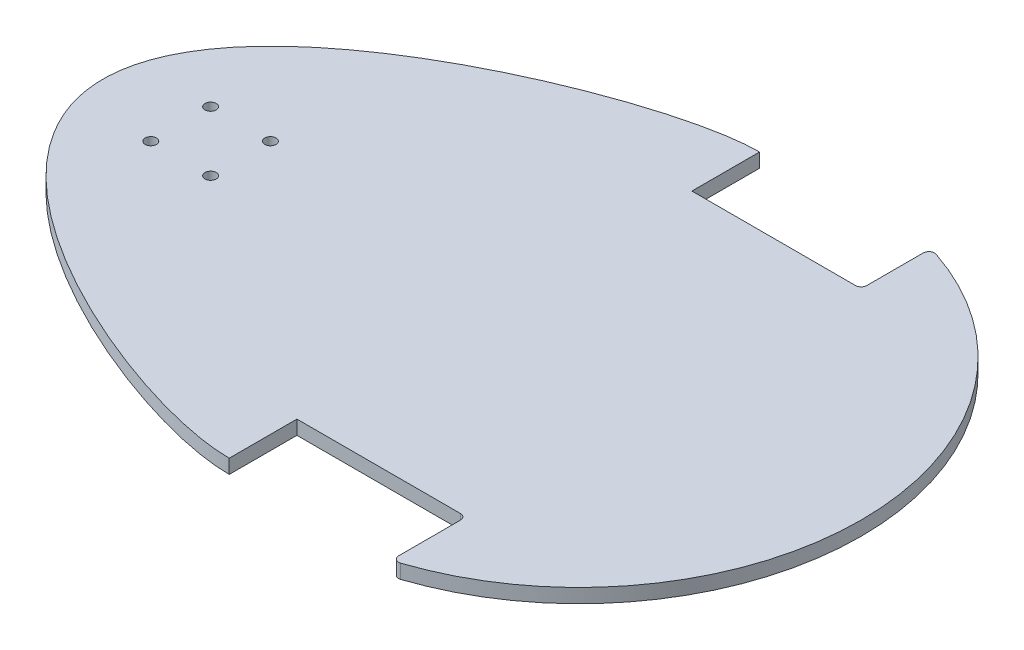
ISO-10303-21;
HEADER;
FILE_DESCRIPTION(('STEP AP214'),'2;1');
FILE_NAME('part.step','',(''),(''),'','','');
FILE_SCHEMA(('AUTOMOTIVE_DESIGN { 1 0 10303 214 1 1 1 1 }'));
ENDSEC;
DATA;
#1=APPLICATION_CONTEXT('core data for automotive mechanical design processes');
#2=APPLICATION_PROTOCOL_DEFINITION('international standard','automotive_design',2000,#1);
#3=PRODUCT_CONTEXT('',#1,'mechanical');
#4=PRODUCT('Part','Part','',(#3));
#5=PRODUCT_RELATED_PRODUCT_CATEGORY('part','',(#4));
#6=PRODUCT_DEFINITION_FORMATION('','',#4);
#7=PRODUCT_DEFINITION_CONTEXT('part definition',#1,'design');
#8=PRODUCT_DEFINITION('design','',#6,#7);
#9=PRODUCT_DEFINITION_SHAPE('','',#8);
#10=(LENGTH_UNIT() NAMED_UNIT(*) SI_UNIT(.MILLI.,.METRE.));
#11=(NAMED_UNIT(*) PLANE_ANGLE_UNIT() SI_UNIT($,.RADIAN.));
#12=(NAMED_UNIT(*) SI_UNIT($,.STERADIAN.) SOLID_ANGLE_UNIT());
#13=UNCERTAINTY_MEASURE_WITH_UNIT(LENGTH_MEASURE(1.E-05),#10,'distance_accuracy_value','');
#14=(GEOMETRIC_REPRESENTATION_CONTEXT(3) GLOBAL_UNCERTAINTY_ASSIGNED_CONTEXT((#13)) GLOBAL_UNIT_ASSIGNED_CONTEXT((#10,
#11,#12)) REPRESENTATION_CONTEXT('',''));
#15=CARTESIAN_POINT('',(0.,0.,0.));
#16=DIRECTION('',(0.,0.,1.));
#17=DIRECTION('',(1.,0.,0.));
#18=AXIS2_PLACEMENT_3D('',#15,#16,#17);
#19=CARTESIAN_POINT('',(-95.19961207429,6.35,115.672720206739));
#20=DIRECTION('',(0.,-1.,0.));
#21=DIRECTION('',(0.,0.,-1.));
#22=AXIS2_PLACEMENT_3D('',#19,#20,#21);
#23=PLANE('',#22);
#24=DIRECTION('',(0.,0.,-1.));
#25=VECTOR('',#24,1.);
#26=CARTESIAN_POINT('',(81.01288792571,6.35,204.572720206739));
#27=LINE('',#26,#25);
#28=CARTESIAN_POINT('',(81.01288792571,6.35,235.052720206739));
#29=VERTEX_POINT('',#28);
#30=CARTESIAN_POINT('',(81.01288792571,6.35,204.572720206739));
#31=VERTEX_POINT('',#30);
#32=EDGE_CURVE('E258',#29,#31,#27,.T.);
#33=ORIENTED_EDGE('',*,*,#32,.T.);
#34=DIRECTION('',(1.,0.,0.));
#35=VECTOR('',#34,1.);
#36=CARTESIAN_POINT('',(81.01288792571,6.35,204.572720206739));
#37=LINE('',#36,#35);
#38=CARTESIAN_POINT('',(154.67288792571,6.35,204.572720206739));
#39=VERTEX_POINT('',#38);
#40=EDGE_CURVE('E105',#31,#39,#37,.T.);
#41=ORIENTED_EDGE('',*,*,#40,.T.);
#42=CARTESIAN_POINT('',(154.67288792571,6.35,207.112720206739));
#43=DIRECTION('',(0.,-1.,0.));
#44=DIRECTION('',(0.,0.,-1.));
#45=AXIS2_PLACEMENT_3D('',#42,#43,#44);
#46=CIRCLE('',#45,2.53999999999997);
#47=CARTESIAN_POINT('',(157.21288792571,6.35,207.112720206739));
#48=VERTEX_POINT('',#47);
#49=EDGE_CURVE('E261',#39,#48,#46,.T.);
#50=ORIENTED_EDGE('',*,*,#49,.T.);
#51=DIRECTION('',(0.,0.,1.));
#52=VECTOR('',#51,1.);
#53=CARTESIAN_POINT('',(157.21288792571,6.35,207.112720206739));
#54=LINE('',#53,#52);
#55=CARTESIAN_POINT('',(157.21288792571,6.35,234.970770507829));
#56=VERTEX_POINT('',#55);
#57=EDGE_CURVE('E263',#48,#56,#54,.T.);
#58=ORIENTED_EDGE('',*,*,#57,.T.);
#59=CARTESIAN_POINT('',(159.75288792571,6.35,234.970770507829));
#60=DIRECTION('',(0.,1.,0.));
#61=DIRECTION('',(0.,0.,1.));
#62=AXIS2_PLACEMENT_3D('',#59,#60,#61);
#63=CIRCLE('',#62,2.54000000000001);
#64=CARTESIAN_POINT('',(160.556357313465,6.35,237.380342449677));
#65=VERTEX_POINT('',#64);
#66=EDGE_CURVE('E265',#56,#65,#63,.T.);
#67=ORIENTED_EDGE('',*,*,#66,.T.);
#68=CARTESIAN_POINT('',(120.38288792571,6.35,116.901745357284));
#69=DIRECTION('',(0.,1.,0.));
#70=DIRECTION('',(0.,0.,1.));
#71=AXIS2_PLACEMENT_3D('',#68,#69,#70);
#72=CIRCLE('',#71,127.);
#73=CARTESIAN_POINT('',(160.556357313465,6.35,-3.57685173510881));
#74=VERTEX_POINT('',#73);
#75=EDGE_CURVE('E267',#65,#74,#72,.T.);
#76=ORIENTED_EDGE('',*,*,#75,.T.);
#77=CARTESIAN_POINT('',(159.75288792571,6.35,-1.16727979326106));
#78=DIRECTION('',(0.,1.,0.));
#79=DIRECTION('',(0.,0.,-1.));
#80=AXIS2_PLACEMENT_3D('',#77,#78,#79);
#81=CIRCLE('',#80,2.53999999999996);
#82=CARTESIAN_POINT('',(157.21288792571,6.35,-1.16727979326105));
#83=VERTEX_POINT('',#82);
#84=EDGE_CURVE('E269',#74,#83,#81,.T.);
#85=ORIENTED_EDGE('',*,*,#84,.T.);
#86=DIRECTION('',(0.,0.,1.));
#87=VECTOR('',#86,1.);
#88=CARTESIAN_POINT('',(157.21288792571,6.35,-1.16727979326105));
#89=LINE('',#88,#87);
#90=CARTESIAN_POINT('',(157.21288792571,6.35,24.2327202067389));
#91=VERTEX_POINT('',#90);
#92=EDGE_CURVE('E271',#83,#91,#89,.T.);
#93=ORIENTED_EDGE('',*,*,#92,.T.);
#94=CARTESIAN_POINT('',(154.67288792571,6.35,24.2327202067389));
#95=DIRECTION('',(0.,-1.,0.));
#96=DIRECTION('',(0.,0.,1.));
#97=AXIS2_PLACEMENT_3D('',#94,#95,#96);
#98=CIRCLE('',#97,2.54000000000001);
#99=CARTESIAN_POINT('',(154.67288792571,6.35,26.772720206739));
#100=VERTEX_POINT('',#99);
#101=EDGE_CURVE('E136',#91,#100,#98,.T.);
#102=ORIENTED_EDGE('',*,*,#101,.T.);
#103=DIRECTION('',(-1.,0.,0.));
#104=VECTOR('',#103,1.);
#105=CARTESIAN_POINT('',(81.01288792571,6.35,26.7727202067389));
#106=LINE('',#105,#104);
#107=CARTESIAN_POINT('',(81.01288792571,6.35,26.7727202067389));
#108=VERTEX_POINT('',#107);
#109=EDGE_CURVE('E130',#100,#108,#106,.T.);
#110=ORIENTED_EDGE('',*,*,#109,.T.);
#111=DIRECTION('',(0.,0.,-1.));
#112=VECTOR('',#111,1.);
#113=CARTESIAN_POINT('',(81.01288792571,6.35,26.7727202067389));
#114=LINE('',#113,#112);
#115=CARTESIAN_POINT('',(81.01288792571,6.35,-3.70727979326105));
#116=VERTEX_POINT('',#115);
#117=EDGE_CURVE('E134',#108,#116,#114,.T.);
#118=ORIENTED_EDGE('',*,*,#117,.T.);
#119=CARTESIAN_POINT('',(81.01288792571,6.35,-3.70727979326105));
#120=CARTESIAN_POINT('',(17.51288792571,6.35,-3.70727979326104));
#121=CARTESIAN_POINT('',(-169.17711207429,6.35,85.1927202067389));
#122=CARTESIAN_POINT('',(-169.17711207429,6.35,146.152720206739));
#123=CARTESIAN_POINT('',(17.51288792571,6.35,235.052720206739));
#124=CARTESIAN_POINT('',(81.01288792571,6.35,235.052720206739));
#125=B_SPLINE_CURVE_WITH_KNOTS('',5,(#119,#120,#121,#122,#123,#124),.UNSPECIFIED.,.F.,.F.,(6,6),
(0.,1.),.UNSPECIFIED.);
#126=EDGE_CURVE('E50',#116,#29,#125,.T.);
#127=ORIENTED_EDGE('',*,*,#126,.T.);
#128=EDGE_LOOP('',(#33,#41,#50,#58,#67,#76,#85,#93,#102,#110,#118,#127));
#129=FACE_BOUND('',#128,.T.);
#130=CARTESIAN_POINT('',(-33.28711207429,6.35,102.210720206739));
#131=DIRECTION('',(0.,1.,0.));
#132=DIRECTION('',(0.,0.,1.));
#133=AXIS2_PLACEMENT_3D('',#130,#131,#132);
#134=CIRCLE('',#133,2.54000000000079);
#135=CARTESIAN_POINT('',(-33.28711207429,6.35,104.75072020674));
#136=VERTEX_POINT('',#135);
#137=EDGE_CURVE('E253',#136,#136,#134,.T.);
#138=ORIENTED_EDGE('',*,*,#137,.F.);
#139=EDGE_LOOP('',(#138));
#140=FACE_BOUND('',#139,.T.);
#141=CARTESIAN_POINT('',(-60.21111207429,6.35,102.210720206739));
#142=DIRECTION('',(0.,1.,0.));
#143=DIRECTION('',(0.,0.,1.));
#144=AXIS2_PLACEMENT_3D('',#141,#142,#143);
#145=CIRCLE('',#144,2.54000000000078);
#146=CARTESIAN_POINT('',(-60.21111207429,6.35,104.75072020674));
#147=VERTEX_POINT('',#146);
#148=EDGE_CURVE('E247',#147,#147,#145,.T.);
#149=ORIENTED_EDGE('',*,*,#148,.F.);
#150=EDGE_LOOP('',(#149));
#151=FACE_BOUND('',#150,.T.);
#152=CARTESIAN_POINT('',(-60.2111120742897,6.35,129.134720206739));
#153=DIRECTION('',(0.,1.,0.));
#154=DIRECTION('',(0.,0.,1.));
#155=AXIS2_PLACEMENT_3D('',#152,#153,#154);
#156=CIRCLE('',#155,2.54000000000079);
#157=CARTESIAN_POINT('',(-60.2111120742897,6.35,131.67472020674));
#158=VERTEX_POINT('',#157);
#159=EDGE_CURVE('E241',#158,#158,#156,.T.);
#160=ORIENTED_EDGE('',*,*,#159,.F.);
#161=EDGE_LOOP('',(#160));
#162=FACE_BOUND('',#161,.T.);
#163=CARTESIAN_POINT('',(-33.2871120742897,6.35,129.134720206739));
#164=DIRECTION('',(0.,1.,0.));
#165=DIRECTION('',(0.,0.,1.));
#166=AXIS2_PLACEMENT_3D('',#163,#164,#165);
#167=CIRCLE('',#166,2.54000000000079);
#168=CARTESIAN_POINT('',(-33.2871120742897,6.35,131.67472020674));
#169=VERTEX_POINT('',#168);
#170=EDGE_CURVE('E232',#169,#169,#167,.T.);
#171=ORIENTED_EDGE('',*,*,#170,.F.);
#172=EDGE_LOOP('',(#171));
#173=FACE_BOUND('',#172,.T.);
#174=ADVANCED_FACE('F33',(#129,#140,#151,#162,#173),#23,.F.);
#175=CARTESIAN_POINT('',(-95.19961207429,0.,115.672720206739));
#176=DIRECTION('',(0.,-1.,0.));
#177=DIRECTION('',(0.,0.,-1.));
#178=AXIS2_PLACEMENT_3D('',#175,#176,#177);
#179=PLANE('',#178);
#180=CARTESIAN_POINT('',(-60.2111120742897,0.,129.134720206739));
#181=DIRECTION('',(0.,1.,0.));
#182=DIRECTION('',(0.,0.,1.));
#183=AXIS2_PLACEMENT_3D('',#180,#181,#182);
#184=CIRCLE('',#183,2.54000000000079);
#185=CARTESIAN_POINT('',(-60.2111120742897,0.,131.67472020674));
#186=VERTEX_POINT('',#185);
#187=EDGE_CURVE('E238',#186,#186,#184,.T.);
#188=ORIENTED_EDGE('',*,*,#187,.T.);
#189=EDGE_LOOP('',(#188));
#190=FACE_BOUND('',#189,.T.);
#191=CARTESIAN_POINT('',(-33.28711207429,0.,102.210720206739));
#192=DIRECTION('',(0.,1.,0.));
#193=DIRECTION('',(0.,0.,1.));
#194=AXIS2_PLACEMENT_3D('',#191,#192,#193);
#195=CIRCLE('',#194,2.54000000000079);
#196=CARTESIAN_POINT('',(-33.28711207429,0.,104.75072020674));
#197=VERTEX_POINT('',#196);
#198=EDGE_CURVE('E250',#197,#197,#195,.T.);
#199=ORIENTED_EDGE('',*,*,#198,.T.);
#200=EDGE_LOOP('',(#199));
#201=FACE_BOUND('',#200,.T.);
#202=DIRECTION('',(0.,0.,-1.));
#203=VECTOR('',#202,1.);
#204=CARTESIAN_POINT('',(81.01288792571,0.,204.572720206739));
#205=LINE('',#204,#203);
#206=CARTESIAN_POINT('',(81.01288792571,0.,235.052720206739));
#207=VERTEX_POINT('',#206);
#208=CARTESIAN_POINT('',(81.01288792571,0.,204.572720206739));
#209=VERTEX_POINT('',#208);
#210=EDGE_CURVE('E157',#207,#209,#205,.T.);
#211=ORIENTED_EDGE('',*,*,#210,.F.);
#212=CARTESIAN_POINT('',(81.01288792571,0.,-3.70727979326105));
#213=CARTESIAN_POINT('',(17.51288792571,0.,-3.70727979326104));
#214=CARTESIAN_POINT('',(-169.17711207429,0.,85.1927202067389));
#215=CARTESIAN_POINT('',(-169.17711207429,0.,146.152720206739));
#216=CARTESIAN_POINT('',(17.51288792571,0.,235.052720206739));
#217=CARTESIAN_POINT('',(81.01288792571,0.,235.052720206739));
#218=B_SPLINE_CURVE_WITH_KNOTS('',5,(#212,#213,#214,#215,#216,#217),.UNSPECIFIED.,.F.,.F.,(6,6),
(0.,1.),.UNSPECIFIED.);
#219=CARTESIAN_POINT('',(81.01288792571,0.,-3.70727979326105));
#220=VERTEX_POINT('',#219);
#221=EDGE_CURVE('E97',#220,#207,#218,.T.);
#222=ORIENTED_EDGE('',*,*,#221,.F.);
#223=DIRECTION('',(0.,0.,-1.));
#224=VECTOR('',#223,1.);
#225=CARTESIAN_POINT('',(81.01288792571,0.,26.7727202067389));
#226=LINE('',#225,#224);
#227=CARTESIAN_POINT('',(81.01288792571,0.,26.7727202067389));
#228=VERTEX_POINT('',#227);
#229=EDGE_CURVE('E91',#228,#220,#226,.T.);
#230=ORIENTED_EDGE('',*,*,#229,.F.);
#231=DIRECTION('',(-1.,0.,0.));
#232=VECTOR('',#231,1.);
#233=CARTESIAN_POINT('',(81.01288792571,0.,26.7727202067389));
#234=LINE('',#233,#232);
#235=CARTESIAN_POINT('',(154.67288792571,0.,26.772720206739));
#236=VERTEX_POINT('',#235);
#237=EDGE_CURVE('E144',#236,#228,#234,.T.);
#238=ORIENTED_EDGE('',*,*,#237,.F.);
#239=CARTESIAN_POINT('',(154.67288792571,0.,24.2327202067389));
#240=DIRECTION('',(0.,-1.,0.));
#241=DIRECTION('',(0.,0.,1.));
#242=AXIS2_PLACEMENT_3D('',#239,#240,#241);
#243=CIRCLE('',#242,2.54000000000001);
#244=CARTESIAN_POINT('',(157.21288792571,0.,24.2327202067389));
#245=VERTEX_POINT('',#244);
#246=EDGE_CURVE('E284',#245,#236,#243,.T.);
#247=ORIENTED_EDGE('',*,*,#246,.F.);
#248=DIRECTION('',(0.,0.,1.));
#249=VECTOR('',#248,1.);
#250=CARTESIAN_POINT('',(157.21288792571,0.,-1.16727979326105));
#251=LINE('',#250,#249);
#252=CARTESIAN_POINT('',(157.21288792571,0.,-1.16727979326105));
#253=VERTEX_POINT('',#252);
#254=EDGE_CURVE('E280',#253,#245,#251,.T.);
#255=ORIENTED_EDGE('',*,*,#254,.F.);
#256=CARTESIAN_POINT('',(159.75288792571,0.,-1.16727979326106));
#257=DIRECTION('',(0.,1.,0.));
#258=DIRECTION('',(0.,0.,-1.));
#259=AXIS2_PLACEMENT_3D('',#256,#257,#258);
#260=CIRCLE('',#259,2.53999999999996);
#261=CARTESIAN_POINT('',(160.556357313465,0.,-3.57685173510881));
#262=VERTEX_POINT('',#261);
#263=EDGE_CURVE('E319',#262,#253,#260,.T.);
#264=ORIENTED_EDGE('',*,*,#263,.F.);
#265=CARTESIAN_POINT('',(120.38288792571,0.,116.901745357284));
#266=DIRECTION('',(0.,1.,0.));
#267=DIRECTION('',(0.,0.,1.));
#268=AXIS2_PLACEMENT_3D('',#265,#266,#267);
#269=CIRCLE('',#268,127.);
#270=CARTESIAN_POINT('',(160.556357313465,0.,237.380342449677));
#271=VERTEX_POINT('',#270);
#272=EDGE_CURVE('E317',#271,#262,#269,.T.);
#273=ORIENTED_EDGE('',*,*,#272,.F.);
#274=CARTESIAN_POINT('',(159.75288792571,0.,234.970770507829));
#275=DIRECTION('',(0.,1.,0.));
#276=DIRECTION('',(0.,0.,1.));
#277=AXIS2_PLACEMENT_3D('',#274,#275,#276);
#278=CIRCLE('',#277,2.54000000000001);
#279=CARTESIAN_POINT('',(157.21288792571,0.,234.970770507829));
#280=VERTEX_POINT('',#279);
#281=EDGE_CURVE('E313',#280,#271,#278,.T.);
#282=ORIENTED_EDGE('',*,*,#281,.F.);
#283=DIRECTION('',(0.,0.,1.));
#284=VECTOR('',#283,1.);
#285=CARTESIAN_POINT('',(157.21288792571,0.,207.112720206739));
#286=LINE('',#285,#284);
#287=CARTESIAN_POINT('',(157.21288792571,0.,207.112720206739));
#288=VERTEX_POINT('',#287);
#289=EDGE_CURVE('E311',#288,#280,#286,.T.);
#290=ORIENTED_EDGE('',*,*,#289,.F.);
#291=CARTESIAN_POINT('',(154.67288792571,0.,207.112720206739));
#292=DIRECTION('',(0.,-1.,0.));
#293=DIRECTION('',(0.,0.,-1.));
#294=AXIS2_PLACEMENT_3D('',#291,#292,#293);
#295=CIRCLE('',#294,2.53999999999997);
#296=CARTESIAN_POINT('',(154.67288792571,0.,204.572720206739));
#297=VERTEX_POINT('',#296);
#298=EDGE_CURVE('E304',#297,#288,#295,.T.);
#299=ORIENTED_EDGE('',*,*,#298,.F.);
#300=DIRECTION('',(1.,0.,0.));
#301=VECTOR('',#300,1.);
#302=CARTESIAN_POINT('',(81.01288792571,0.,204.572720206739));
#303=LINE('',#302,#301);
#304=EDGE_CURVE('E309',#209,#297,#303,.T.);
#305=ORIENTED_EDGE('',*,*,#304,.F.);
#306=EDGE_LOOP('',(#211,#222,#230,#238,#247,#255,#264,#273,#282,#290,#299,#305));
#307=FACE_BOUND('',#306,.T.);
#308=CARTESIAN_POINT('',(-60.21111207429,0.,102.210720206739));
#309=DIRECTION('',(0.,1.,0.));
#310=DIRECTION('',(0.,0.,1.));
#311=AXIS2_PLACEMENT_3D('',#308,#309,#310);
#312=CIRCLE('',#311,2.54000000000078);
#313=CARTESIAN_POINT('',(-60.21111207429,0.,104.75072020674));
#314=VERTEX_POINT('',#313);
#315=EDGE_CURVE('E244',#314,#314,#312,.T.);
#316=ORIENTED_EDGE('',*,*,#315,.T.);
#317=EDGE_LOOP('',(#316));
#318=FACE_BOUND('',#317,.T.);
#319=CARTESIAN_POINT('',(-33.2871120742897,0.,129.134720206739));
#320=DIRECTION('',(0.,1.,0.));
#321=DIRECTION('',(0.,0.,1.));
#322=AXIS2_PLACEMENT_3D('',#319,#320,#321);
#323=CIRCLE('',#322,2.54000000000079);
#324=CARTESIAN_POINT('',(-33.2871120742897,0.,131.67472020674));
#325=VERTEX_POINT('',#324);
#326=EDGE_CURVE('E235',#325,#325,#323,.T.);
#327=ORIENTED_EDGE('',*,*,#326,.T.);
#328=EDGE_LOOP('',(#327));
#329=FACE_BOUND('',#328,.T.);
#330=ADVANCED_FACE('F168',(#190,#201,#307,#318,#329),#179,.T.);
#331=CARTESIAN_POINT('',(81.01288792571,6.35,204.572720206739));
#332=DIRECTION('',(-1.,0.,0.));
#333=DIRECTION('',(0.,0.,1.));
#334=AXIS2_PLACEMENT_3D('',#331,#332,#333);
#335=PLANE('',#334);
#336=ORIENTED_EDGE('',*,*,#210,.T.);
#337=DIRECTION('',(0.,-1.,0.));
#338=VECTOR('',#337,1.);
#339=CARTESIAN_POINT('',(81.01288792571,6.35,204.572720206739));
#340=LINE('',#339,#338);
#341=EDGE_CURVE('E11',#31,#209,#340,.T.);
#342=ORIENTED_EDGE('',*,*,#341,.F.);
#343=ORIENTED_EDGE('',*,*,#32,.F.);
#344=DIRECTION('',(0.,-1.,0.));
#345=VECTOR('',#344,1.);
#346=CARTESIAN_POINT('',(81.01288792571,6.35,235.052720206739));
#347=LINE('',#346,#345);
#348=EDGE_CURVE('E150',#29,#207,#347,.T.);
#349=ORIENTED_EDGE('',*,*,#348,.T.);
#350=EDGE_LOOP('',(#336,#342,#343,#349));
#351=FACE_BOUND('',#350,.T.);
#352=ADVANCED_FACE('F35',(#351),#335,.F.);
#353=CARTESIAN_POINT('',(81.01288792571,6.35,204.572720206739));
#354=DIRECTION('',(0.,0.,-1.));
#355=DIRECTION('',(-1.,0.,0.));
#356=AXIS2_PLACEMENT_3D('',#353,#354,#355);
#357=PLANE('',#356);
#358=ORIENTED_EDGE('',*,*,#304,.T.);
#359=DIRECTION('',(0.,-1.,0.));
#360=VECTOR('',#359,1.);
#361=CARTESIAN_POINT('',(154.67288792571,6.35,204.572720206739));
#362=LINE('',#361,#360);
#363=EDGE_CURVE('E42',#39,#297,#362,.T.);
#364=ORIENTED_EDGE('',*,*,#363,.F.);
#365=ORIENTED_EDGE('',*,*,#40,.F.);
#366=ORIENTED_EDGE('',*,*,#341,.T.);
#367=EDGE_LOOP('',(#358,#364,#365,#366));
#368=FACE_BOUND('',#367,.T.);
#369=ADVANCED_FACE('F200',(#368),#357,.F.);
#370=CARTESIAN_POINT('',(154.67288792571,6.35,207.112720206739));
#371=DIRECTION('',(0.,-1.,0.));
#372=DIRECTION('',(0.,0.,-1.));
#373=AXIS2_PLACEMENT_3D('',#370,#371,#372);
#374=CYLINDRICAL_SURFACE('',#373,2.53999999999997);
#375=ORIENTED_EDGE('',*,*,#298,.T.);
#376=DIRECTION('',(0.,-1.,0.));
#377=VECTOR('',#376,1.);
#378=CARTESIAN_POINT('',(157.21288792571,6.35,207.112720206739));
#379=LINE('',#378,#377);
#380=EDGE_CURVE('E298',#48,#288,#379,.T.);
#381=ORIENTED_EDGE('',*,*,#380,.F.);
#382=ORIENTED_EDGE('',*,*,#49,.F.);
#383=ORIENTED_EDGE('',*,*,#363,.T.);
#384=EDGE_LOOP('',(#375,#381,#382,#383));
#385=FACE_BOUND('',#384,.T.);
#386=ADVANCED_FACE('F197',(#385),#374,.F.);
#387=CARTESIAN_POINT('',(157.21288792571,6.35,207.112720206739));
#388=DIRECTION('',(1.,0.,0.));
#389=DIRECTION('',(0.,0.,-1.));
#390=AXIS2_PLACEMENT_3D('',#387,#388,#389);
#391=PLANE('',#390);
#392=ORIENTED_EDGE('',*,*,#289,.T.);
#393=DIRECTION('',(0.,-1.,0.));
#394=VECTOR('',#393,1.);
#395=CARTESIAN_POINT('',(157.21288792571,6.35,234.970770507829));
#396=LINE('',#395,#394);
#397=EDGE_CURVE('E295',#56,#280,#396,.T.);
#398=ORIENTED_EDGE('',*,*,#397,.F.);
#399=ORIENTED_EDGE('',*,*,#57,.F.);
#400=ORIENTED_EDGE('',*,*,#380,.T.);
#401=EDGE_LOOP('',(#392,#398,#399,#400));
#402=FACE_BOUND('',#401,.T.);
#403=ADVANCED_FACE('F193',(#402),#391,.F.);
#404=CARTESIAN_POINT('',(159.75288792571,6.35,234.970770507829));
#405=DIRECTION('',(0.,-1.,0.));
#406=DIRECTION('',(0.,0.,-1.));
#407=AXIS2_PLACEMENT_3D('',#404,#405,#406);
#408=CYLINDRICAL_SURFACE('',#407,2.54000000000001);
#409=ORIENTED_EDGE('',*,*,#281,.T.);
#410=DIRECTION('',(0.,-1.,0.));
#411=VECTOR('',#410,1.);
#412=CARTESIAN_POINT('',(160.556357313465,6.35,237.380342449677));
#413=LINE('',#412,#411);
#414=EDGE_CURVE('E292',#65,#271,#413,.T.);
#415=ORIENTED_EDGE('',*,*,#414,.F.);
#416=ORIENTED_EDGE('',*,*,#66,.F.);
#417=ORIENTED_EDGE('',*,*,#397,.T.);
#418=EDGE_LOOP('',(#409,#415,#416,#417));
#419=FACE_BOUND('',#418,.T.);
#420=ADVANCED_FACE('F189',(#419),#408,.T.);
#421=CARTESIAN_POINT('',(120.38288792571,6.35,116.901745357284));
#422=DIRECTION('',(0.,-1.,0.));
#423=DIRECTION('',(0.,0.,-1.));
#424=AXIS2_PLACEMENT_3D('',#421,#422,#423);
#425=CYLINDRICAL_SURFACE('',#424,127.);
#426=ORIENTED_EDGE('',*,*,#272,.T.);
#427=DIRECTION('',(0.,-1.,0.));
#428=VECTOR('',#427,1.);
#429=CARTESIAN_POINT('',(160.556357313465,6.35,-3.57685173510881));
#430=LINE('',#429,#428);
#431=EDGE_CURVE('E289',#74,#262,#430,.T.);
#432=ORIENTED_EDGE('',*,*,#431,.F.);
#433=ORIENTED_EDGE('',*,*,#75,.F.);
#434=ORIENTED_EDGE('',*,*,#414,.T.);
#435=EDGE_LOOP('',(#426,#432,#433,#434));
#436=FACE_BOUND('',#435,.T.);
#437=ADVANCED_FACE('F185',(#436),#425,.T.);
#438=CARTESIAN_POINT('',(159.75288792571,6.35,-1.16727979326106));
#439=DIRECTION('',(0.,-1.,0.));
#440=DIRECTION('',(0.,0.,-1.));
#441=AXIS2_PLACEMENT_3D('',#438,#439,#440);
#442=CYLINDRICAL_SURFACE('',#441,2.53999999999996);
#443=ORIENTED_EDGE('',*,*,#263,.T.);
#444=DIRECTION('',(0.,-1.,0.));
#445=VECTOR('',#444,1.);
#446=CARTESIAN_POINT('',(157.21288792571,6.35,-1.16727979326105));
#447=LINE('',#446,#445);
#448=EDGE_CURVE('E282',#83,#253,#447,.T.);
#449=ORIENTED_EDGE('',*,*,#448,.F.);
#450=ORIENTED_EDGE('',*,*,#84,.F.);
#451=ORIENTED_EDGE('',*,*,#431,.T.);
#452=EDGE_LOOP('',(#443,#449,#450,#451));
#453=FACE_BOUND('',#452,.T.);
#454=ADVANCED_FACE('F181',(#453),#442,.T.);
#455=CARTESIAN_POINT('',(157.21288792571,6.35,-1.16727979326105));
#456=DIRECTION('',(1.,0.,0.));
#457=DIRECTION('',(0.,0.,-1.));
#458=AXIS2_PLACEMENT_3D('',#455,#456,#457);
#459=PLANE('',#458);
#460=ORIENTED_EDGE('',*,*,#254,.T.);
#461=DIRECTION('',(0.,-1.,0.));
#462=VECTOR('',#461,1.);
#463=CARTESIAN_POINT('',(157.21288792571,6.35,24.2327202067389));
#464=LINE('',#463,#462);
#465=EDGE_CURVE('E278',#91,#245,#464,.T.);
#466=ORIENTED_EDGE('',*,*,#465,.F.);
#467=ORIENTED_EDGE('',*,*,#92,.F.);
#468=ORIENTED_EDGE('',*,*,#448,.T.);
#469=EDGE_LOOP('',(#460,#466,#467,#468));
#470=FACE_BOUND('',#469,.T.);
#471=ADVANCED_FACE('F177',(#470),#459,.F.);
#472=CARTESIAN_POINT('',(154.67288792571,6.35,24.2327202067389));
#473=DIRECTION('',(0.,-1.,0.));
#474=DIRECTION('',(0.,0.,-1.));
#475=AXIS2_PLACEMENT_3D('',#472,#473,#474);
#476=CYLINDRICAL_SURFACE('',#475,2.54000000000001);
#477=ORIENTED_EDGE('',*,*,#246,.T.);
#478=DIRECTION('',(0.,-1.,0.));
#479=VECTOR('',#478,1.);
#480=CARTESIAN_POINT('',(154.67288792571,6.35,26.772720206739));
#481=LINE('',#480,#479);
#482=EDGE_CURVE('E145',#100,#236,#481,.T.);
#483=ORIENTED_EDGE('',*,*,#482,.F.);
#484=ORIENTED_EDGE('',*,*,#101,.F.);
#485=ORIENTED_EDGE('',*,*,#465,.T.);
#486=EDGE_LOOP('',(#477,#483,#484,#485));
#487=FACE_BOUND('',#486,.T.);
#488=ADVANCED_FACE('F174',(#487),#476,.F.);
#489=CARTESIAN_POINT('',(81.01288792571,6.35,26.7727202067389));
#490=DIRECTION('',(0.,0.,1.));
#491=DIRECTION('',(1.,0.,0.));
#492=AXIS2_PLACEMENT_3D('',#489,#490,#491);
#493=PLANE('',#492);
#494=ORIENTED_EDGE('',*,*,#237,.T.);
#495=DIRECTION('',(0.,-1.,0.));
#496=VECTOR('',#495,1.);
#497=CARTESIAN_POINT('',(81.01288792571,6.35,26.7727202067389));
#498=LINE('',#497,#496);
#499=EDGE_CURVE('E141',#108,#228,#498,.T.);
#500=ORIENTED_EDGE('',*,*,#499,.F.);
#501=ORIENTED_EDGE('',*,*,#109,.F.);
#502=ORIENTED_EDGE('',*,*,#482,.T.);
#503=EDGE_LOOP('',(#494,#500,#501,#502));
#504=FACE_BOUND('',#503,.T.);
#505=ADVANCED_FACE('F142',(#504),#493,.F.);
#506=CARTESIAN_POINT('',(81.01288792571,6.35,26.7727202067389));
#507=DIRECTION('',(-1.,0.,0.));
#508=DIRECTION('',(0.,0.,1.));
#509=AXIS2_PLACEMENT_3D('',#506,#507,#508);
#510=PLANE('',#509);
#511=ORIENTED_EDGE('',*,*,#229,.T.);
#512=DIRECTION('',(0.,-1.,0.));
#513=VECTOR('',#512,1.);
#514=CARTESIAN_POINT('',(81.01288792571,6.35,-3.70727979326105));
#515=LINE('',#514,#513);
#516=EDGE_CURVE('E146',#116,#220,#515,.T.);
#517=ORIENTED_EDGE('',*,*,#516,.F.);
#518=ORIENTED_EDGE('',*,*,#117,.F.);
#519=ORIENTED_EDGE('',*,*,#499,.T.);
#520=EDGE_LOOP('',(#511,#517,#518,#519));
#521=FACE_BOUND('',#520,.T.);
#522=ADVANCED_FACE('F148',(#521),#510,.F.);
#523=DIRECTION('',(0.,-1.,0.));
#524=VECTOR('',#523,1.);
#525=SURFACE_OF_LINEAR_EXTRUSION('',#125,#524);
#526=ORIENTED_EDGE('',*,*,#221,.T.);
#527=ORIENTED_EDGE('',*,*,#348,.F.);
#528=ORIENTED_EDGE('',*,*,#126,.F.);
#529=ORIENTED_EDGE('',*,*,#516,.T.);
#530=EDGE_LOOP('',(#526,#527,#528,#529));
#531=FACE_BOUND('',#530,.T.);
#532=ADVANCED_FACE('F163',(#531),#525,.F.);
#533=CARTESIAN_POINT('',(-33.28711207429,6.35,102.210720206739));
#534=DIRECTION('',(0.,-1.,0.));
#535=DIRECTION('',(0.,0.,-1.));
#536=AXIS2_PLACEMENT_3D('',#533,#534,#535);
#537=CYLINDRICAL_SURFACE('',#536,2.54000000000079);
#538=ORIENTED_EDGE('',*,*,#137,.T.);
#539=EDGE_LOOP('',(#538));
#540=FACE_BOUND('',#539,.T.);
#541=ORIENTED_EDGE('',*,*,#198,.F.);
#542=EDGE_LOOP('',(#541));
#543=FACE_BOUND('',#542,.T.);
#544=ADVANCED_FACE('F167',(#540,#543),#537,.F.);
#545=CARTESIAN_POINT('',(-60.21111207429,6.35,102.210720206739));
#546=DIRECTION('',(0.,-1.,0.));
#547=DIRECTION('',(0.,0.,-1.));
#548=AXIS2_PLACEMENT_3D('',#545,#546,#547);
#549=CYLINDRICAL_SURFACE('',#548,2.54000000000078);
#550=ORIENTED_EDGE('',*,*,#148,.T.);
#551=EDGE_LOOP('',(#550));
#552=FACE_BOUND('',#551,.T.);
#553=ORIENTED_EDGE('',*,*,#315,.F.);
#554=EDGE_LOOP('',(#553));
#555=FACE_BOUND('',#554,.T.);
#556=ADVANCED_FACE('F215',(#552,#555),#549,.F.);
#557=CARTESIAN_POINT('',(-60.2111120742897,6.35,129.134720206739));
#558=DIRECTION('',(0.,-1.,0.));
#559=DIRECTION('',(0.,0.,-1.));
#560=AXIS2_PLACEMENT_3D('',#557,#558,#559);
#561=CYLINDRICAL_SURFACE('',#560,2.54000000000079);
#562=ORIENTED_EDGE('',*,*,#159,.T.);
#563=EDGE_LOOP('',(#562));
#564=FACE_BOUND('',#563,.T.);
#565=ORIENTED_EDGE('',*,*,#187,.F.);
#566=EDGE_LOOP('',(#565));
#567=FACE_BOUND('',#566,.T.);
#568=ADVANCED_FACE('F219',(#564,#567),#561,.F.);
#569=CARTESIAN_POINT('',(-33.2871120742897,6.35,129.134720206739));
#570=DIRECTION('',(0.,-1.,0.));
#571=DIRECTION('',(0.,0.,-1.));
#572=AXIS2_PLACEMENT_3D('',#569,#570,#571);
#573=CYLINDRICAL_SURFACE('',#572,2.54000000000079);
#574=ORIENTED_EDGE('',*,*,#170,.T.);
#575=EDGE_LOOP('',(#574));
#576=FACE_BOUND('',#575,.T.);
#577=ORIENTED_EDGE('',*,*,#326,.F.);
#578=EDGE_LOOP('',(#577));
#579=FACE_BOUND('',#578,.T.);
#580=ADVANCED_FACE('F223',(#576,#579),#573,.F.);
#581=CLOSED_SHELL('',(#174,#330,#352,#369,#386,#403,#420,#437,#454,#471,#488,#505,#522,#532,
#544,#556,#568,#580));
#582=MANIFOLD_SOLID_BREP('B2',#581);
#583=ADVANCED_BREP_SHAPE_REPRESENTATION('',(#18,#582),#14);
#584=SHAPE_DEFINITION_REPRESENTATION(#9,#583);
ENDSEC;
END-ISO-10303-21;
